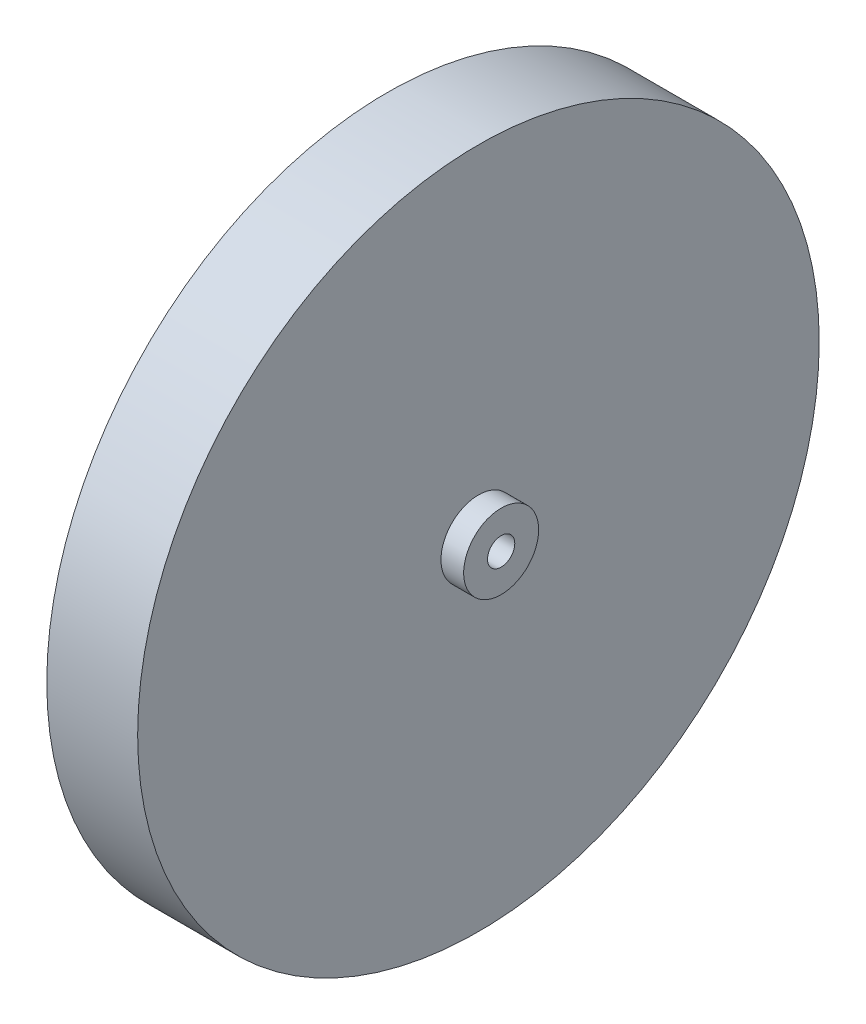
from build123d import *

# Parameters (mm, degrees)
SKETCH1_R           = 38.1
BOSS_EXTRUDE1_DEPTH = 10.16
SKETCH3_R           = 4.191
BOSS_EXTRUDE2_DEPTH = 2.54
SKETCH4_R           = 1.524
CUT_EXTRUDE1_DEPTH  = 56.358016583


with BuildPart() as part:
    # Sketch1 → Boss-Extrude1 (new body)
    with BuildSketch(Plane(origin=(0, 0, 0), x_dir=(0, 0, -1), z_dir=(1, 0, 0))):
        Circle(SKETCH1_R)
    extrude(amount=BOSS_EXTRUDE1_DEPTH)

    # Sketch3 → Boss-Extrude2 (add)
    with BuildSketch(Plane(origin=(10.16, 0, 0), x_dir=(0, 0, -1), z_dir=(1, 0, 0))):
        Circle(SKETCH3_R)
    extrude(amount=BOSS_EXTRUDE2_DEPTH)

    # Sketch4 → Cut-Extrude1 (cut, through all)
    with BuildSketch(Plane(origin=(12.7, 0, 0), x_dir=(0, 0, -1), z_dir=(1, 0, 0))):
        Circle(SKETCH4_R)
    extrude(amount=-CUT_EXTRUDE1_DEPTH, mode=Mode.SUBTRACT)


solid = part.part
